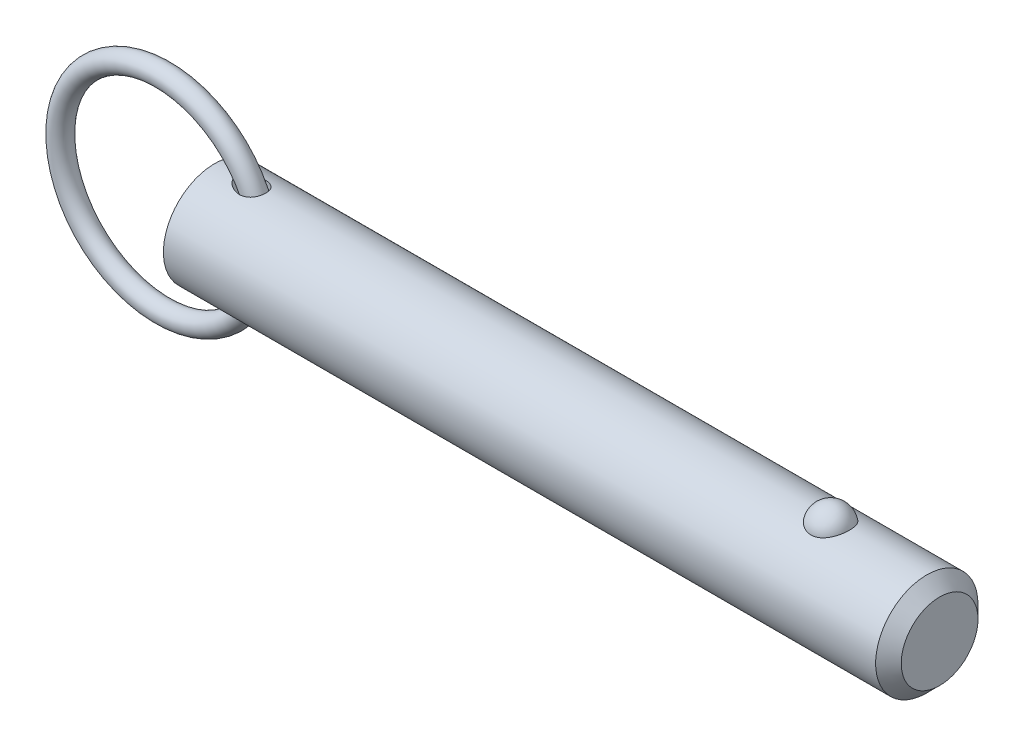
ISO-10303-21;
HEADER;
FILE_DESCRIPTION(('STEP AP214'),'2;1');
FILE_NAME('part.step','',(''),(''),'','','');
FILE_SCHEMA(('AUTOMOTIVE_DESIGN { 1 0 10303 214 1 1 1 1 }'));
ENDSEC;
DATA;
#1=APPLICATION_CONTEXT('core data for automotive mechanical design processes');
#2=APPLICATION_PROTOCOL_DEFINITION('international standard','automotive_design',2000,#1);
#3=PRODUCT_CONTEXT('',#1,'mechanical');
#4=PRODUCT('Part','Part','',(#3));
#5=PRODUCT_RELATED_PRODUCT_CATEGORY('part','',(#4));
#6=PRODUCT_DEFINITION_FORMATION('','',#4);
#7=PRODUCT_DEFINITION_CONTEXT('part definition',#1,'design');
#8=PRODUCT_DEFINITION('design','',#6,#7);
#9=PRODUCT_DEFINITION_SHAPE('','',#8);
#10=(LENGTH_UNIT() NAMED_UNIT(*) SI_UNIT(.MILLI.,.METRE.));
#11=(NAMED_UNIT(*) PLANE_ANGLE_UNIT() SI_UNIT($,.RADIAN.));
#12=(NAMED_UNIT(*) SI_UNIT($,.STERADIAN.) SOLID_ANGLE_UNIT());
#13=UNCERTAINTY_MEASURE_WITH_UNIT(LENGTH_MEASURE(1.E-05),#10,'distance_accuracy_value','');
#14=(GEOMETRIC_REPRESENTATION_CONTEXT(3) GLOBAL_UNCERTAINTY_ASSIGNED_CONTEXT((#13)) GLOBAL_UNIT_ASSIGNED_CONTEXT((#10,
#11,#12)) REPRESENTATION_CONTEXT('',''));
#15=CARTESIAN_POINT('',(0.,0.,0.));
#16=DIRECTION('',(0.,0.,1.));
#17=DIRECTION('',(1.,0.,0.));
#18=AXIS2_PLACEMENT_3D('',#15,#16,#17);
#19=CARTESIAN_POINT('',(-9.66825126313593,0.,0.));
#20=DIRECTION('',(0.,0.,1.));
#21=DIRECTION('',(1.,0.,0.));
#22=AXIS2_PLACEMENT_3D('',#19,#20,#21);
#23=TOROIDAL_SURFACE('',#22,19.05,1.905);
#24=CARTESIAN_POINT('',(11.2867487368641,0.,0.));
#25=VERTEX_POINT('',#24);
#26=VERTEX_LOOP('',#25);
#27=FACE_BOUND('',#26,.T.);
#28=ADVANCED_FACE('P0_F12',(#27),#23,.T.);
#29=CLOSED_SHELL('',(#28));
#30=MANIFOLD_SOLID_BREP('P0_B1',#29);
#31=CARTESIAN_POINT('',(0.,0.,0.));
#32=DIRECTION('',(1.,0.,0.));
#33=DIRECTION('',(0.,0.,-1.));
#34=AXIS2_PLACEMENT_3D('',#31,#32,#33);
#35=CYLINDRICAL_SURFACE('',#34,9.525);
#36=CARTESIAN_POINT('',(4.56693409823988,9.43141941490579,-1.33189820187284));
#37=CARTESIAN_POINT('',(4.70260475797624,9.41020313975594,-1.48215931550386));
#38=CARTESIAN_POINT('',(4.85555680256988,9.38755003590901,-1.61683982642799));
#39=CARTESIAN_POINT('',(5.10171959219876,9.35450554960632,-1.79512943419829));
#40=CARTESIAN_POINT('',(5.18674514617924,9.34362629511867,-1.85068909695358));
#41=CARTESIAN_POINT('',(5.36154389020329,9.32258514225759,-1.95392002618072));
#42=CARTESIAN_POINT('',(5.45131542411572,9.31242299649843,-2.00159402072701));
#43=CARTESIAN_POINT('',(5.70070211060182,9.28632120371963,-2.12033289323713));
#44=CARTESIAN_POINT('',(5.86420408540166,9.27146938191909,-2.18362944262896));
#45=CARTESIAN_POINT('',(6.19893345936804,9.24694163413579,-2.28525783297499));
#46=CARTESIAN_POINT('',(6.37015384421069,9.23726110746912,-2.32361187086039));
#47=CARTESIAN_POINT('',(6.73531776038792,9.22400982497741,-2.37575048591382));
#48=CARTESIAN_POINT('',(6.92975826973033,9.22118808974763,-2.38652934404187));
#49=CARTESIAN_POINT('',(7.21995443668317,9.22416297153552,-2.37494980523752));
#50=CARTESIAN_POINT('',(7.31643847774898,9.22635560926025,-2.366466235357));
#51=CARTESIAN_POINT('',(7.50796421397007,9.2331428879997,-2.33985028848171));
#52=CARTESIAN_POINT('',(7.60300650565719,9.23773650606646,-2.32172202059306));
#53=CARTESIAN_POINT('',(7.83273114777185,9.25183311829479,-2.26504721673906));
#54=CARTESIAN_POINT('',(7.96603028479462,9.26261470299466,-2.2209856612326));
#55=CARTESIAN_POINT('',(8.22310899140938,9.28816519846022,-2.11157306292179));
#56=CARTESIAN_POINT('',(8.34689477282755,9.30293147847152,-2.04623606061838));
#57=CARTESIAN_POINT('',(8.58136049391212,9.3349416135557,-1.89485344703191));
#58=CARTESIAN_POINT('',(8.69199721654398,9.35219324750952,-1.80874222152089));
#59=CARTESIAN_POINT('',(8.89592093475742,9.38707016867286,-1.61799188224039));
#60=CARTESIAN_POINT('',(8.98920771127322,9.40469546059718,-1.51335253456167));
#61=CARTESIAN_POINT('',(9.15057731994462,9.43713590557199,-1.29519427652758));
#62=CARTESIAN_POINT('',(9.21980158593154,9.45205440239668,-1.18253282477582));
#63=CARTESIAN_POINT('',(9.33826736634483,9.47856708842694,-0.946802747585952));
#64=CARTESIAN_POINT('',(9.38751161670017,9.49016173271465,-0.823735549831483));
#65=CARTESIAN_POINT('',(9.46423850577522,9.50859378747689,-0.572614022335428));
#66=CARTESIAN_POINT('',(9.4920239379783,9.5154972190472,-0.444656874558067));
#67=CARTESIAN_POINT('',(9.52636926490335,9.52406905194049,-0.185752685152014));
#68=CARTESIAN_POINT('',(9.5329292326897,9.52573747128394,-0.0548056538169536));
#69=CARTESIAN_POINT('',(9.52467276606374,9.52365852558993,0.206503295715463));
#70=CARTESIAN_POINT('',(9.50983454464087,9.51990564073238,0.336864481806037));
#71=CARTESIAN_POINT('',(9.45907362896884,9.50737852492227,0.59316631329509));
#72=CARTESIAN_POINT('',(9.42315106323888,9.49860432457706,0.71910698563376));
#73=CARTESIAN_POINT('',(9.33106648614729,9.47698928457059,0.96295935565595));
#74=CARTESIAN_POINT('',(9.27490839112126,9.46414923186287,1.08087260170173));
#75=CARTESIAN_POINT('',(9.1437580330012,9.43581000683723,1.30534632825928));
#76=CARTESIAN_POINT('',(9.06876720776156,9.42031103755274,1.41190767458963));
#77=CARTESIAN_POINT('',(8.90203187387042,9.38836719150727,1.61069439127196));
#78=CARTESIAN_POINT('',(8.81029913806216,9.37192298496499,1.70292975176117));
#79=CARTESIAN_POINT('',(8.61268775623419,9.33985045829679,1.87086859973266));
#80=CARTESIAN_POINT('',(8.50680947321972,9.3242221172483,1.94657251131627));
#81=CARTESIAN_POINT('',(8.28220546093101,9.29513431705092,2.08109032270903));
#82=CARTESIAN_POINT('',(8.16329919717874,9.28171415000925,2.1396103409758));
#83=CARTESIAN_POINT('',(7.91756052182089,9.25859072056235,2.23755716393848));
#84=CARTESIAN_POINT('',(7.79072606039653,9.24888842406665,2.27697900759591));
#85=CARTESIAN_POINT('',(7.52377913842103,9.23338749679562,2.33907806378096));
#86=CARTESIAN_POINT('',(7.38334767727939,9.22789571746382,2.36044900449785));
#87=CARTESIAN_POINT('',(7.10081394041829,9.22210229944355,2.3829751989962));
#88=CARTESIAN_POINT('',(6.95871103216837,9.22180269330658,2.38412253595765));
#89=CARTESIAN_POINT('',(6.65642691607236,9.22632724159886,2.36656230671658));
#90=CARTESIAN_POINT('',(6.49641694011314,9.23185415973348,2.3451317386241));
#91=CARTESIAN_POINT('',(6.18115433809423,9.24811737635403,2.28014143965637));
#92=CARTESIAN_POINT('',(6.02590710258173,9.25885936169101,2.23655754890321));
#93=CARTESIAN_POINT('',(5.6990472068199,9.28624254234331,2.12025087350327));
#94=CARTESIAN_POINT('',(5.52873601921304,9.30354853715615,2.04400672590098));
#95=CARTESIAN_POINT('',(5.20289495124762,9.34106989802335,1.86504730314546));
#96=CARTESIAN_POINT('',(5.04735968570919,9.36128419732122,1.76234172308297));
#97=CARTESIAN_POINT('',(4.79287124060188,9.39697639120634,1.55895334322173));
#98=CARTESIAN_POINT('',(4.68938704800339,9.41240250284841,1.46392900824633));
#99=CARTESIAN_POINT('',(4.49847141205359,9.44202586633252,1.25875918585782));
#100=CARTESIAN_POINT('',(4.41101129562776,9.45622528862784,1.1486413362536));
#101=CARTESIAN_POINT('',(4.27502257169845,9.47888210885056,0.940600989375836));
#102=CARTESIAN_POINT('',(4.22216329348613,9.48791121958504,0.845586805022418));
#103=CARTESIAN_POINT('',(4.13241478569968,9.50344321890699,0.648051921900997));
#104=CARTESIAN_POINT('',(4.09551182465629,9.50994827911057,0.545537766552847));
#105=CARTESIAN_POINT('',(4.04043124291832,9.51971586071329,0.334452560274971));
#106=CARTESIAN_POINT('',(4.02240728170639,9.52295176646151,0.225839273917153));
#107=CARTESIAN_POINT('',(4.00750873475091,9.52562364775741,0.00713006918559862));
#108=CARTESIAN_POINT('',(4.01062334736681,9.52506156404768,-0.10296506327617));
#109=CARTESIAN_POINT('',(4.03592967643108,9.52053221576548,-0.306944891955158));
#110=CARTESIAN_POINT('',(4.05571676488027,9.51699426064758,-0.401151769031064));
#111=CARTESIAN_POINT('',(4.10967975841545,9.5074546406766,-0.585176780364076));
#112=CARTESIAN_POINT('',(4.14385995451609,9.50145224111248,-0.674993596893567));
#113=CARTESIAN_POINT('',(4.23261356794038,9.48611703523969,-0.866116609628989));
#114=CARTESIAN_POINT('',(4.28990016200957,9.47635800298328,-0.96612166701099));
#115=CARTESIAN_POINT('',(4.41856577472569,9.45502867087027,-1.15640011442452));
#116=CARTESIAN_POINT('',(4.48996918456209,9.44345524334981,-1.24665623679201));
#117=CARTESIAN_POINT('',(4.56693409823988,9.43141941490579,-1.33189820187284));
#118=B_SPLINE_CURVE_WITH_KNOTS('',3,(#36,#37,#38,#39,#40,#41,#42,#43,#44,#45,#46,#47,#48,#49,
#50,#51,#52,#53,#54,#55,#56,#57,#58,#59,#60,#61,#62,#63,#64,#65,#66,#67,#68,#69,#70,#71,#72,#73,
#74,#75,#76,#77,#78,#79,#80,#81,#82,#83,#84,#85,#86,#87,#88,#89,#90,#91,#92,#93,#94,#95,#96,#97,
#98,#99,#100,#101,#102,#103,#104,#105,#106,#107,#108,#109,#110,#111,#112,#113,#114,#115,#116,
#117),.UNSPECIFIED.,.T.,.F.,(4,2,2,2,2,2,2,2,2,2,2,2,2,2,2,2,2,2,2,2,2,2,2,2,2,2,2,2,2,2,2,2,2,
2,2,2,2,2,2,2,4),(0.,0.609951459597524,0.916123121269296,1.22218863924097,1.74791337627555,
2.27316961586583,2.85362722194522,3.14383229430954,3.43391382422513,3.85437497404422,
4.27455920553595,4.69608835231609,5.11762282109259,5.5149005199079,5.91212379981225,
6.30363414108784,6.69514313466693,7.08705103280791,7.47895654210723,7.87078624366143,
8.26258603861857,8.65411137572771,9.04562666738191,9.44349251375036,9.84146165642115,
10.2662286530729,10.6911619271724,11.1739180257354,11.6572017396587,12.2170157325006,
12.7766249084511,13.1992556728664,13.6211226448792,13.9471990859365,14.2729943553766,
14.6014211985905,14.9296802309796,15.2173810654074,15.505167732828,15.8505863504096,
16.1966070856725),.UNSPECIFIED.);
#119=CARTESIAN_POINT('',(4.56693409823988,9.43141941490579,-1.33189820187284));
#120=VERTEX_POINT('',#119);
#121=EDGE_CURVE('P1_E40',#120,#120,#118,.T.);
#122=ORIENTED_EDGE('',*,*,#121,.T.);
#123=EDGE_LOOP('',(#122));
#124=FACE_BOUND('',#123,.T.);
#125=CARTESIAN_POINT('',(132.54875,0.,0.));
#126=DIRECTION('',(1.,0.,0.));
#127=DIRECTION('',(0.,0.,-1.));
#128=AXIS2_PLACEMENT_3D('',#125,#126,#127);
#129=CIRCLE('',#128,9.525);
#130=CARTESIAN_POINT('',(132.54875,0.,-9.525));
#131=VERTEX_POINT('',#130);
#132=EDGE_CURVE('P1_E25',#131,#131,#129,.T.);
#133=ORIENTED_EDGE('',*,*,#132,.F.);
#134=EDGE_LOOP('',(#133));
#135=FACE_BOUND('',#134,.T.);
#136=CARTESIAN_POINT('',(0.,0.,0.));
#137=DIRECTION('',(1.,0.,0.));
#138=DIRECTION('',(0.,0.,-1.));
#139=AXIS2_PLACEMENT_3D('',#136,#137,#138);
#140=CIRCLE('',#139,9.525);
#141=CARTESIAN_POINT('',(0.,0.,-9.525));
#142=VERTEX_POINT('',#141);
#143=EDGE_CURVE('P1_E9',#142,#142,#140,.T.);
#144=ORIENTED_EDGE('',*,*,#143,.T.);
#145=EDGE_LOOP('',(#144));
#146=FACE_BOUND('',#145,.T.);
#147=CARTESIAN_POINT('',(114.645757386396,8.80405803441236,3.63513233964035));
#148=CARTESIAN_POINT('',(114.551676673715,8.80405953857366,3.63513053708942));
#149=CARTESIAN_POINT('',(114.457561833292,8.80561325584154,3.6313746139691));
#150=CARTESIAN_POINT('',(114.270012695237,8.81177748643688,3.61638665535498));
#151=CARTESIAN_POINT('',(114.176578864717,8.81638992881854,3.60514990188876));
#152=CARTESIAN_POINT('',(113.897945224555,8.8346711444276,3.56024627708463));
#153=CARTESIAN_POINT('',(113.714691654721,8.85278327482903,3.51538626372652));
#154=CARTESIAN_POINT('',(113.359509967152,8.89871214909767,3.39742145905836));
#155=CARTESIAN_POINT('',(113.187553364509,8.9265032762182,3.32439116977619));
#156=CARTESIAN_POINT('',(112.858707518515,8.98874819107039,3.15220244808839));
#157=CARTESIAN_POINT('',(112.701811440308,9.02319893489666,3.05305594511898));
#158=CARTESIAN_POINT('',(112.402214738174,9.09629186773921,2.82797815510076));
#159=CARTESIAN_POINT('',(112.260060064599,9.13502685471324,2.7013513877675));
#160=CARTESIAN_POINT('',(111.998299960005,9.2118657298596,2.4264193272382));
#161=CARTESIAN_POINT('',(111.878701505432,9.2499694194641,2.27810735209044));
#162=CARTESIAN_POINT('',(111.659645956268,9.3234108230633,1.95652290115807));
#163=CARTESIAN_POINT('',(111.561317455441,9.35855090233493,1.78243511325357));
#164=CARTESIAN_POINT('',(111.393819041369,9.42045142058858,1.41937246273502));
#165=CARTESIAN_POINT('',(111.324651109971,9.44721128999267,1.23039658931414));
#166=CARTESIAN_POINT('',(111.216199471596,9.48990641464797,0.840370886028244));
#167=CARTESIAN_POINT('',(111.177288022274,9.50570658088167,0.639202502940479));
#168=CARTESIAN_POINT('',(111.131555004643,9.52433146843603,0.232664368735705));
#169=CARTESIAN_POINT('',(111.124732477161,9.52715657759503,0.0272947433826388));
#170=CARTESIAN_POINT('',(111.143255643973,9.51956918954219,-0.380478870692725));
#171=CARTESIAN_POINT('',(111.168405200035,9.50923740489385,-0.58289331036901));
#172=CARTESIAN_POINT('',(111.25002537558,9.47651897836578,-0.980293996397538));
#173=CARTESIAN_POINT('',(111.306496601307,9.45413210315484,-1.17528009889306));
#174=CARTESIAN_POINT('',(111.449719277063,9.39954044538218,-1.55263697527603));
#175=CARTESIAN_POINT('',(111.536512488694,9.36732213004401,-1.73498993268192));
#176=CARTESIAN_POINT('',(111.738610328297,9.29640700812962,-2.08177763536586));
#177=CARTESIAN_POINT('',(111.853917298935,9.25770966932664,-2.24621090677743));
#178=CARTESIAN_POINT('',(112.111264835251,9.17775604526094,-2.5533833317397));
#179=CARTESIAN_POINT('',(112.253434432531,9.136488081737,-2.696011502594));
#180=CARTESIAN_POINT('',(112.56089985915,9.05620497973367,-2.95451229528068));
#181=CARTESIAN_POINT('',(112.726193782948,9.01718965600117,-3.07038711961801));
#182=CARTESIAN_POINT('',(113.072052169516,8.9468001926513,-3.26976836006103));
#183=CARTESIAN_POINT('',(113.252227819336,8.91528408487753,-3.35389750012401));
#184=CARTESIAN_POINT('',(113.625651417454,8.86272514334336,-3.49043503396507));
#185=CARTESIAN_POINT('',(113.818894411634,8.8416783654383,-3.54285537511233));
#186=CARTESIAN_POINT('',(114.202503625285,8.81348056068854,-3.61241306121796));
#187=CARTESIAN_POINT('',(114.392525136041,8.80568348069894,-3.63119339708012));
#188=CARTESIAN_POINT('',(114.773190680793,8.80289410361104,-3.63795342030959));
#189=CARTESIAN_POINT('',(114.963834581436,8.80789922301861,-3.62593932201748));
#190=CARTESIAN_POINT('',(115.334007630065,8.8297491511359,-3.57238430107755));
#191=CARTESIAN_POINT('',(115.513697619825,8.84621463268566,-3.53178890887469));
#192=CARTESIAN_POINT('',(115.863422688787,8.88875330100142,-3.42331083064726));
#193=CARTESIAN_POINT('',(116.033456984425,8.91482726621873,-3.35542593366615));
#194=CARTESIAN_POINT('',(116.363237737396,8.97448239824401,-3.19248225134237));
#195=CARTESIAN_POINT('',(116.522680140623,9.00821446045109,-3.09686474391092));
#196=CARTESIAN_POINT('',(116.823513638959,9.07935398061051,-2.88162736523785));
#197=CARTESIAN_POINT('',(116.964900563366,9.11676228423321,-2.76200196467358));
#198=CARTESIAN_POINT('',(117.23331931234,9.19347419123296,-2.49516285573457));
#199=CARTESIAN_POINT('',(117.359275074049,9.23277872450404,-2.34686614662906));
#200=CARTESIAN_POINT('',(117.585522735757,9.30737610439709,-2.03093683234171));
#201=CARTESIAN_POINT('',(117.68581004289,9.34266823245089,-1.86330077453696));
#202=CARTESIAN_POINT('',(117.861514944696,9.40674710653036,-1.50744893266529));
#203=CARTESIAN_POINT('',(117.936041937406,9.4352917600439,-1.31874876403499));
#204=CARTESIAN_POINT('',(118.05416505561,9.48144132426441,-0.930631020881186));
#205=CARTESIAN_POINT('',(118.097760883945,9.49904612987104,-0.731213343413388));
#206=CARTESIAN_POINT('',(118.153158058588,9.5215314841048,-0.327147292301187));
#207=CARTESIAN_POINT('',(118.164935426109,9.52640243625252,-0.122495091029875));
#208=CARTESIAN_POINT('',(118.156382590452,9.52289571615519,0.286018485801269));
#209=CARTESIAN_POINT('',(118.13605305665,9.51451832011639,0.489879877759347));
#210=CARTESIAN_POINT('',(118.063884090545,9.48544083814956,0.88999431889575));
#211=CARTESIAN_POINT('',(118.012199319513,9.46480124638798,1.08627971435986));
#212=CARTESIAN_POINT('',(117.878491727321,9.4133389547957,1.46682086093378));
#213=CARTESIAN_POINT('',(117.796466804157,9.38251554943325,1.65107577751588));
#214=CARTESIAN_POINT('',(117.60319292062,9.31365636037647,2.00346348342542));
#215=CARTESIAN_POINT('',(117.491783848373,9.27558138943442,2.17150083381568));
#216=CARTESIAN_POINT('',(117.242294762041,9.19638714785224,2.48563115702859));
#217=CARTESIAN_POINT('',(117.104216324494,9.15526805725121,2.63172542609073));
#218=CARTESIAN_POINT('',(116.804843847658,9.07465393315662,2.89750997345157));
#219=CARTESIAN_POINT('',(116.643610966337,9.03515496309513,3.01726776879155));
#220=CARTESIAN_POINT('',(116.301613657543,8.96227564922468,3.22732920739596));
#221=CARTESIAN_POINT('',(116.120841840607,8.92889763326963,3.31762165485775));
#222=CARTESIAN_POINT('',(115.751445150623,8.8734538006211,3.46314419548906));
#223=CARTESIAN_POINT('',(115.56332371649,8.85102983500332,3.51950082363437));
#224=CARTESIAN_POINT('',(115.27578699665,8.8266696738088,3.57993683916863));
#225=CARTESIAN_POINT('',(115.179133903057,8.82009725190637,3.59606217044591));
#226=CARTESIAN_POINT('',(114.984677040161,8.81020897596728,3.62022512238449));
#227=CARTESIAN_POINT('',(114.88687410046,8.80689090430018,3.62826825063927));
#228=CARTESIAN_POINT('',(114.741224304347,8.80445615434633,3.63416760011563));
#229=CARTESIAN_POINT('',(114.693495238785,8.80405727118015,3.63513325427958));
#230=CARTESIAN_POINT('',(114.645757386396,8.80405803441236,3.63513233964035));
#231=B_SPLINE_CURVE_WITH_KNOTS('',3,(#147,#148,#149,#150,#151,#152,#153,#154,#155,#156,#157,
#158,#159,#160,#161,#162,#163,#164,#165,#166,#167,#168,#169,#170,#171,#172,#173,#174,#175,#176,
#177,#178,#179,#180,#181,#182,#183,#184,#185,#186,#187,#188,#189,#190,#191,#192,#193,#194,#195,
#196,#197,#198,#199,#200,#201,#202,#203,#204,#205,#206,#207,#208,#209,#210,#211,#212,#213,#214,
#215,#216,#217,#218,#219,#220,#221,#222,#223,#224,#225,#226,#227,#228,#229,#230),.UNSPECIFIED.,
.T.,.F.,(4,2,2,2,2,2,2,2,2,2,2,2,2,2,2,2,2,2,2,2,2,2,2,2,2,2,2,2,2,2,2,2,2,2,2,2,2,2,2,2,2,4),
(0.,0.282202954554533,0.564584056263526,1.13017050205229,1.69427128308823,2.258114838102,
2.83836627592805,3.41879688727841,4.02497117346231,4.63118665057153,5.24474754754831,
5.85829010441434,6.46808687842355,7.07789545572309,7.68854723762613,8.29924920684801,
8.91296283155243,9.52662591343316,10.1275338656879,10.7282152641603,11.2986646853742,
11.868998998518,12.4213015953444,12.973648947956,13.5380053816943,14.1024919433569,
14.695298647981,15.2882113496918,15.8999469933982,16.5116885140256,17.1238909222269,
17.7360805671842,18.3452748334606,18.9545113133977,19.567138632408,20.1797297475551,
20.7907316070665,21.4019653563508,21.9915938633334,22.2859053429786,22.5800161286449,
22.723209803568),.UNSPECIFIED.);
#232=CARTESIAN_POINT('',(114.645757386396,8.80405803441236,3.63513233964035));
#233=VERTEX_POINT('',#232);
#234=EDGE_CURVE('P1_E34',#233,#233,#231,.T.);
#235=ORIENTED_EDGE('',*,*,#234,.T.);
#236=EDGE_LOOP('',(#235));
#237=FACE_BOUND('',#236,.T.);
#238=CARTESIAN_POINT('',(4.56693409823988,-9.43141941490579,-1.33189820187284));
#239=CARTESIAN_POINT('',(4.48932984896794,-9.4435553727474,-1.24594548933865));
#240=CARTESIAN_POINT('',(4.41737309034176,-9.45522193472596,-1.1548795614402));
#241=CARTESIAN_POINT('',(4.2878104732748,-9.47670896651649,-0.962782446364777));
#242=CARTESIAN_POINT('',(4.23019403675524,-9.48653079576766,-0.861758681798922));
#243=CARTESIAN_POINT('',(4.13254559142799,-9.5034118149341,-0.649723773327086));
#244=CARTESIAN_POINT('',(4.09271158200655,-9.51043980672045,-0.538615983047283));
#245=CARTESIAN_POINT('',(4.04973167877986,-9.51806966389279,-0.367764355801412));
#246=CARTESIAN_POINT('',(4.03820037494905,-9.52012756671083,-0.310118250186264));
#247=CARTESIAN_POINT('',(4.02100287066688,-9.52320274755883,-0.193935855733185));
#248=CARTESIAN_POINT('',(4.01533565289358,-9.52422020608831,-0.13539972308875));
#249=CARTESIAN_POINT('',(4.00817074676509,-9.52550497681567,0.0247266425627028));
#250=CARTESIAN_POINT('',(4.01270492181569,-9.52468821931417,0.126661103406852));
#251=CARTESIAN_POINT('',(4.03954973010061,-9.51988506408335,0.328012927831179));
#252=CARTESIAN_POINT('',(4.06186450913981,-9.51589792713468,0.427429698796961));
#253=CARTESIAN_POINT('',(4.12088980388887,-9.5054852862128,0.61636200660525));
#254=CARTESIAN_POINT('',(4.15684838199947,-9.49918763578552,0.706123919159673));
#255=CARTESIAN_POINT('',(4.24094647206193,-9.48470618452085,0.879522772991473));
#256=CARTESIAN_POINT('',(4.28909090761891,-9.47652162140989,0.96315722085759));
#257=CARTESIAN_POINT('',(4.42295891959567,-9.45426317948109,1.16513741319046));
#258=CARTESIAN_POINT('',(4.5152375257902,-9.43933320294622,1.27905352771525));
#259=CARTESIAN_POINT('',(4.71682295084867,-9.40825940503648,1.49055892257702));
#260=CARTESIAN_POINT('',(4.8261728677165,-9.39211256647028,1.58810554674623));
#261=CARTESIAN_POINT('',(5.09064226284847,-9.35555264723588,1.79246125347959));
#262=CARTESIAN_POINT('',(5.24990411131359,-9.33524115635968,1.89393122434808));
#263=CARTESIAN_POINT('',(5.58309255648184,-9.29785396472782,2.06968659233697));
#264=CARTESIAN_POINT('',(5.7570289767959,-9.28078045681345,2.14395359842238));
#265=CARTESIAN_POINT('',(6.11646882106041,-9.25213303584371,2.26440412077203));
#266=CARTESIAN_POINT('',(6.30205582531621,-9.2406056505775,2.31035092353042));
#267=CARTESIAN_POINT('',(6.67856093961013,-9.22541807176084,2.37029728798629));
#268=CARTESIAN_POINT('',(6.8694704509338,-9.2217458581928,2.3843456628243));
#269=CARTESIAN_POINT('',(7.21217144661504,-9.22344239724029,2.37775005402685));
#270=CARTESIAN_POINT('',(7.36409439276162,-9.22713860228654,2.36352577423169));
#271=CARTESIAN_POINT('',(7.66346227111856,-9.24048072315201,2.31082299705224));
#272=CARTESIAN_POINT('',(7.81090958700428,-9.25012341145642,2.27235765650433));
#273=CARTESIAN_POINT('',(8.09730316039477,-9.2746609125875,2.17003648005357));
#274=CARTESIAN_POINT('',(8.23619652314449,-9.28958517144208,2.10603803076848));
#275=CARTESIAN_POINT('',(8.49918675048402,-9.32290326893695,1.9532444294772));
#276=CARTESIAN_POINT('',(8.62328895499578,-9.34129584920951,1.86445826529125));
#277=CARTESIAN_POINT('',(8.84006515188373,-9.37706953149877,1.67466761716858));
#278=CARTESIAN_POINT('',(8.93465172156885,-9.39436331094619,1.57582357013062));
#279=CARTESIAN_POINT('',(9.1049023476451,-9.42761680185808,1.362809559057));
#280=CARTESIAN_POINT('',(9.18057146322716,-9.44357686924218,1.24864370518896));
#281=CARTESIAN_POINT('',(9.30789178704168,-9.47159985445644,1.01379272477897));
#282=CARTESIAN_POINT('',(9.36045544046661,-9.48380365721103,0.893617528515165));
#283=CARTESIAN_POINT('',(9.44498362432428,-9.50388751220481,0.645890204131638));
#284=CARTESIAN_POINT('',(9.47694947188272,-9.51176784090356,0.518338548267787));
#285=CARTESIAN_POINT('',(9.51944262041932,-9.52232073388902,0.260103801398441));
#286=CARTESIAN_POINT('',(9.53006646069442,-9.52501674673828,0.129437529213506));
#287=CARTESIAN_POINT('',(9.52993291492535,-9.52498309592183,-0.131885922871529));
#288=CARTESIAN_POINT('',(9.51917525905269,-9.52225336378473,-0.262543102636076));
#289=CARTESIAN_POINT('',(9.47648788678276,-9.51165418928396,-0.520312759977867));
#290=CARTESIAN_POINT('',(9.44453086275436,-9.50377811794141,-0.647420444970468));
#291=CARTESIAN_POINT('',(9.36015568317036,-9.48373425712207,-0.894290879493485));
#292=CARTESIAN_POINT('',(9.30773827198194,-9.47156662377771,-1.01405389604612));
#293=CARTESIAN_POINT('',(9.18380895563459,-9.44428888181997,-1.24269386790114));
#294=CARTESIAN_POINT('',(9.11232064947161,-9.42918241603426,-1.3515840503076));
#295=CARTESIAN_POINT('',(8.95212687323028,-9.39767706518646,-1.55562459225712));
#296=CARTESIAN_POINT('',(8.86342281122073,-9.3812782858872,-1.65077607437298));
#297=CARTESIAN_POINT('',(8.6710444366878,-9.34891827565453,-1.82517515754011));
#298=CARTESIAN_POINT('',(8.56732858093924,-9.33295841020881,-1.90437711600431));
#299=CARTESIAN_POINT('',(8.34818438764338,-9.30317889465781,-2.0449122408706));
#300=CARTESIAN_POINT('',(8.23275529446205,-9.2893593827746,-2.10624425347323));
#301=CARTESIAN_POINT('',(7.98961240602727,-9.26475003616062,-2.2120340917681));
#302=CARTESIAN_POINT('',(7.86162088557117,-9.25407358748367,-2.25587700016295));
#303=CARTESIAN_POINT('',(7.60027499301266,-9.23720810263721,-2.32397032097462));
#304=CARTESIAN_POINT('',(7.46691858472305,-9.23102078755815,-2.34821321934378));
#305=CARTESIAN_POINT('',(7.18516230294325,-9.22302718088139,-2.37943079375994));
#306=CARTESIAN_POINT('',(7.0365445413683,-9.22169704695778,-2.38452997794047));
#307=CARTESIAN_POINT('',(6.74015049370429,-9.22442327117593,-2.37395141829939));
#308=CARTESIAN_POINT('',(6.59237455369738,-9.22848170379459,-2.35826567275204));
#309=CARTESIAN_POINT('',(6.27762777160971,-9.2422287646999,-2.30385559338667));
#310=CARTESIAN_POINT('',(6.11124715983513,-9.25269504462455,-2.26192683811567));
#311=CARTESIAN_POINT('',(5.78635920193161,-9.27830776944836,-2.15445569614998));
#312=CARTESIAN_POINT('',(5.62786567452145,-9.29346211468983,-2.08887341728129));
#313=CARTESIAN_POINT('',(5.3901306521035,-9.31931237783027,-1.96924953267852));
#314=CARTESIAN_POINT('',(5.30683088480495,-9.32901725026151,-1.92292485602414));
#315=CARTESIAN_POINT('',(5.14455801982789,-9.34899035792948,-1.82334419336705));
#316=CARTESIAN_POINT('',(5.06558607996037,-9.35925874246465,-1.77008636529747));
#317=CARTESIAN_POINT('',(4.83670950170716,-9.39034445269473,-1.60010986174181));
#318=CARTESIAN_POINT('',(4.69422471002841,-9.41151337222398,-1.47288240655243));
#319=CARTESIAN_POINT('',(4.56693409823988,-9.43141941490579,-1.33189820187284));
#320=B_SPLINE_CURVE_WITH_KNOTS('',3,(#238,#239,#240,#241,#242,#243,#244,#245,#246,#247,#248,
#249,#250,#251,#252,#253,#254,#255,#256,#257,#258,#259,#260,#261,#262,#263,#264,#265,#266,#267,
#268,#269,#270,#271,#272,#273,#274,#275,#276,#277,#278,#279,#280,#281,#282,#283,#284,#285,#286,
#287,#288,#289,#290,#291,#292,#293,#294,#295,#296,#297,#298,#299,#300,#301,#302,#303,#304,#305,
#306,#307,#308,#309,#310,#311,#312,#313,#314,#315,#316,#317,#318,#319),.UNSPECIFIED.,.T.,.F.,(4,
2,2,2,2,2,2,2,2,2,2,2,2,2,2,2,2,2,2,2,2,2,2,2,2,2,2,2,2,2,2,2,2,2,2,2,2,2,2,2,4),(0.,
0.348900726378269,0.697543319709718,1.0499765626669,1.22617690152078,1.40234666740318,
1.70666745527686,2.01105922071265,2.30066493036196,2.59038784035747,3.03001384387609,
3.4707682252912,4.03766594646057,4.60494622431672,5.17690598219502,5.74798989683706,
6.2040084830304,6.65977977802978,7.11813321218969,7.57632066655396,7.98791759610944,
8.39940433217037,8.79273459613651,9.18603970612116,9.577561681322,9.96908859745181,
10.3611208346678,10.7531388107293,11.1446739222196,11.536177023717,11.9287850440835,
12.3214184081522,12.7268448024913,13.1324265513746,13.5768390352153,14.0214226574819,
14.5351685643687,15.0497849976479,15.3368801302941,15.6240516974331,16.1963372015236),.UNSPECIFIED.);
#321=CARTESIAN_POINT('',(4.56693409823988,-9.43141941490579,-1.33189820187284));
#322=VERTEX_POINT('',#321);
#323=EDGE_CURVE('P1_E17',#322,#322,#320,.T.);
#324=ORIENTED_EDGE('',*,*,#323,.T.);
#325=EDGE_LOOP('',(#324));
#326=FACE_BOUND('',#325,.T.);
#327=ADVANCED_FACE('P1_F13',(#124,#135,#146,#237,#326),#35,.T.);
#328=CARTESIAN_POINT('',(0.,0.,0.));
#329=DIRECTION('',(-1.,0.,0.));
#330=DIRECTION('',(0.,0.,1.));
#331=AXIS2_PLACEMENT_3D('',#328,#329,#330);
#332=PLANE('',#331);
#333=ORIENTED_EDGE('',*,*,#143,.F.);
#334=EDGE_LOOP('',(#333));
#335=FACE_BOUND('',#334,.T.);
#336=ADVANCED_FACE('P1_F15',(#335),#332,.T.);
#337=CARTESIAN_POINT('',(134.93,0.,0.));
#338=DIRECTION('',(-1.,0.,0.));
#339=DIRECTION('',(0.,0.,1.));
#340=AXIS2_PLACEMENT_3D('',#337,#338,#339);
#341=CONICAL_SURFACE('',#340,7.14375000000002,0.78539816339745);
#342=ORIENTED_EDGE('',*,*,#132,.T.);
#343=EDGE_LOOP('',(#342));
#344=FACE_BOUND('',#343,.T.);
#345=CARTESIAN_POINT('',(134.93,0.,0.));
#346=DIRECTION('',(1.,0.,0.));
#347=DIRECTION('',(0.,0.,-1.));
#348=AXIS2_PLACEMENT_3D('',#345,#346,#347);
#349=CIRCLE('',#348,7.14375000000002);
#350=CARTESIAN_POINT('',(134.93,0.,-7.14375000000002));
#351=VERTEX_POINT('',#350);
#352=EDGE_CURVE('P1_E30',#351,#351,#349,.T.);
#353=ORIENTED_EDGE('',*,*,#352,.F.);
#354=EDGE_LOOP('',(#353));
#355=FACE_BOUND('',#354,.T.);
#356=ADVANCED_FACE('P1_F55',(#344,#355),#341,.T.);
#357=CARTESIAN_POINT('',(134.93,7.14375000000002,0.));
#358=DIRECTION('',(1.,0.,0.));
#359=DIRECTION('',(0.,0.,-1.));
#360=AXIS2_PLACEMENT_3D('',#357,#358,#359);
#361=PLANE('',#360);
#362=ORIENTED_EDGE('',*,*,#352,.T.);
#363=EDGE_LOOP('',(#362));
#364=FACE_BOUND('',#363,.T.);
#365=ADVANCED_FACE('P1_F51',(#364),#361,.T.);
#366=CARTESIAN_POINT('',(114.645757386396,8.57249999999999,0.));
#367=DIRECTION('',(-1.,0.,0.));
#368=DIRECTION('',(0.,1.,0.));
#369=AXIS2_PLACEMENT_3D('',#366,#367,#368);
#370=SPHERICAL_SURFACE('',#369,3.64250000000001);
#371=ORIENTED_EDGE('',*,*,#234,.F.);
#372=EDGE_LOOP('',(#371));
#373=FACE_BOUND('',#372,.T.);
#374=ADVANCED_FACE('P1_F46',(#373),#370,.T.);
#375=CARTESIAN_POINT('',(-9.66825126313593,0.,0.));
#376=DIRECTION('',(0.,0.,1.));
#377=DIRECTION('',(1.,0.,0.));
#378=AXIS2_PLACEMENT_3D('',#375,#376,#377);
#379=TOROIDAL_SURFACE('',#378,19.05,2.38125);
#380=ORIENTED_EDGE('',*,*,#323,.F.);
#381=EDGE_LOOP('',(#380));
#382=FACE_BOUND('',#381,.T.);
#383=ORIENTED_EDGE('',*,*,#121,.F.);
#384=EDGE_LOOP('',(#383));
#385=FACE_BOUND('',#384,.T.);
#386=ADVANCED_FACE('P1_F50',(#382,#385),#379,.F.);
#387=CLOSED_SHELL('',(#327,#336,#356,#365,#374,#386));
#388=MANIFOLD_SOLID_BREP('P1_B1',#387);
#389=ADVANCED_BREP_SHAPE_REPRESENTATION('',(#18,#30,#388),#14);
#390=SHAPE_DEFINITION_REPRESENTATION(#9,#389);
ENDSEC;
END-ISO-10303-21;
